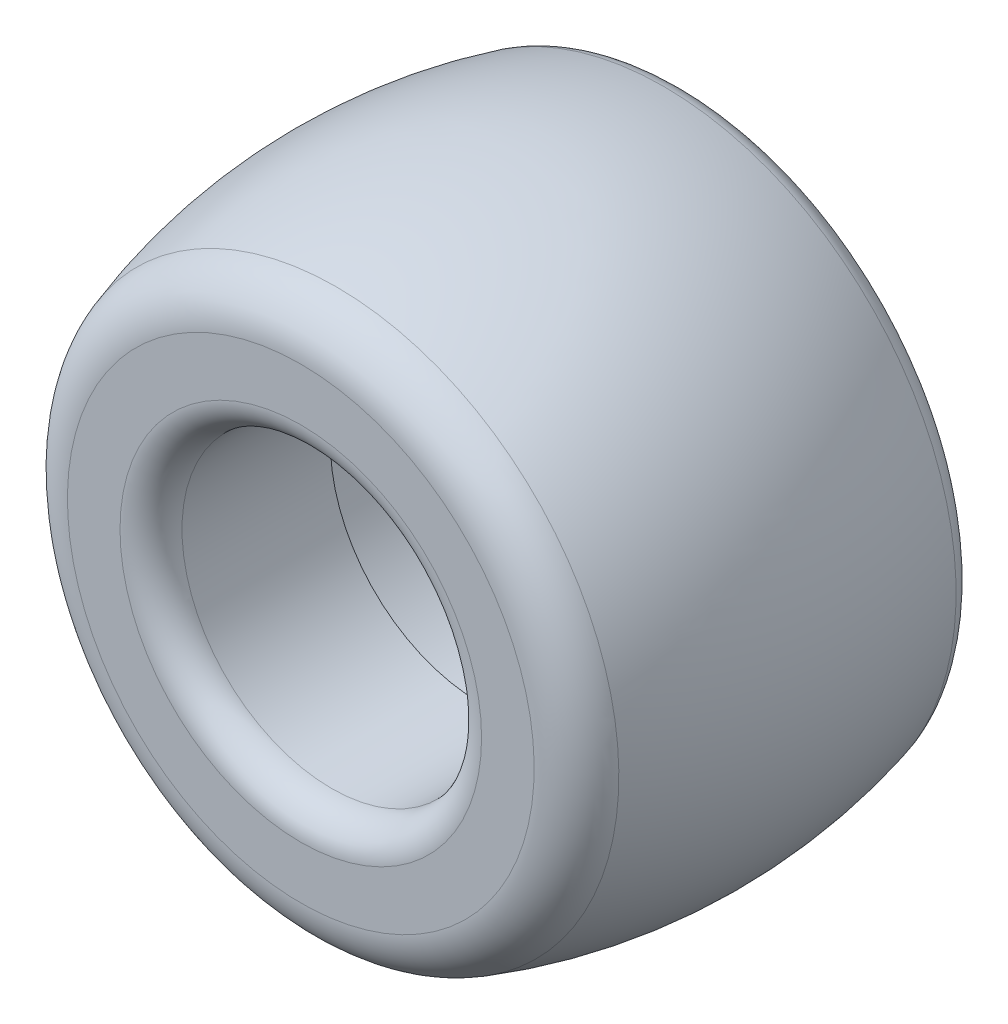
ISO-10303-21;
HEADER;
FILE_DESCRIPTION(('STEP AP214'),'2;1');
FILE_NAME('part.step','',(''),(''),'','','');
FILE_SCHEMA(('AUTOMOTIVE_DESIGN { 1 0 10303 214 1 1 1 1 }'));
ENDSEC;
DATA;
#1=APPLICATION_CONTEXT('core data for automotive mechanical design processes');
#2=APPLICATION_PROTOCOL_DEFINITION('international standard','automotive_design',2000,#1);
#3=PRODUCT_CONTEXT('',#1,'mechanical');
#4=PRODUCT('Part','Part','',(#3));
#5=PRODUCT_RELATED_PRODUCT_CATEGORY('part','',(#4));
#6=PRODUCT_DEFINITION_FORMATION('','',#4);
#7=PRODUCT_DEFINITION_CONTEXT('part definition',#1,'design');
#8=PRODUCT_DEFINITION('design','',#6,#7);
#9=PRODUCT_DEFINITION_SHAPE('','',#8);
#10=(LENGTH_UNIT() NAMED_UNIT(*) SI_UNIT(.MILLI.,.METRE.));
#11=(NAMED_UNIT(*) PLANE_ANGLE_UNIT() SI_UNIT($,.RADIAN.));
#12=(NAMED_UNIT(*) SI_UNIT($,.STERADIAN.) SOLID_ANGLE_UNIT());
#13=UNCERTAINTY_MEASURE_WITH_UNIT(LENGTH_MEASURE(1.E-05),#10,'distance_accuracy_value','');
#14=(GEOMETRIC_REPRESENTATION_CONTEXT(3) GLOBAL_UNCERTAINTY_ASSIGNED_CONTEXT((#13)) GLOBAL_UNIT_ASSIGNED_CONTEXT((#10,
#11,#12)) REPRESENTATION_CONTEXT('',''));
#15=CARTESIAN_POINT('',(0.,0.,0.));
#16=DIRECTION('',(0.,0.,1.));
#17=DIRECTION('',(1.,0.,0.));
#18=AXIS2_PLACEMENT_3D('',#15,#16,#17);
#19=CARTESIAN_POINT('',(-1716.29568384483,509.395199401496,-869.670725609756));
#20=DIRECTION('',(0.,0.,-1.));
#21=DIRECTION('',(0.,1.,0.));
#22=AXIS2_PLACEMENT_3D('',#19,#20,#21);
#23=CYLINDRICAL_SURFACE('',#22,14.4999999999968);
#24=CARTESIAN_POINT('',(-1716.29568384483,509.395199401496,-887.03564012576));
#25=DIRECTION('',(0.,0.,-1.));
#26=DIRECTION('',(0.,1.,0.));
#27=AXIS2_PLACEMENT_3D('',#24,#25,#26);
#28=CIRCLE('',#27,14.5000000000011);
#29=CARTESIAN_POINT('',(-1716.29568384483,523.895199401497,-887.03564012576));
#30=VERTEX_POINT('',#29);
#31=EDGE_CURVE('E10',#30,#30,#28,.T.);
#32=ORIENTED_EDGE('',*,*,#31,.T.);
#33=EDGE_LOOP('',(#32));
#34=FACE_BOUND('',#33,.T.);
#35=CARTESIAN_POINT('',(-1716.29568384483,509.395199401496,-872.670725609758));
#36=DIRECTION('',(0.,0.,-1.));
#37=DIRECTION('',(0.,1.,0.));
#38=AXIS2_PLACEMENT_3D('',#35,#36,#37);
#39=CIRCLE('',#38,14.4999999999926);
#40=CARTESIAN_POINT('',(-1716.29568384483,523.895199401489,-872.670725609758));
#41=VERTEX_POINT('',#40);
#42=EDGE_CURVE('E60',#41,#41,#39,.T.);
#43=ORIENTED_EDGE('',*,*,#42,.F.);
#44=EDGE_LOOP('',(#43));
#45=FACE_BOUND('',#44,.T.);
#46=ADVANCED_FACE('F29',(#34,#45),#23,.F.);
#47=CARTESIAN_POINT('',(-1701.79568384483,509.395199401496,-887.03564012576));
#48=DIRECTION('',(0.,0.,-1.));
#49=DIRECTION('',(0.,1.,0.));
#50=AXIS2_PLACEMENT_3D('',#47,#48,#49);
#51=PLANE('',#50);
#52=CARTESIAN_POINT('',(-1716.29568384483,509.395199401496,-887.03564012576));
#53=DIRECTION('',(0.,0.,-1.));
#54=DIRECTION('',(0.,1.,0.));
#55=AXIS2_PLACEMENT_3D('',#52,#53,#54);
#56=CIRCLE('',#55,17.5000000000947);
#57=CARTESIAN_POINT('',(-1716.29568384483,526.895199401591,-887.03564012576));
#58=VERTEX_POINT('',#57);
#59=EDGE_CURVE('E35',#58,#58,#56,.T.);
#60=ORIENTED_EDGE('',*,*,#59,.T.);
#61=EDGE_LOOP('',(#60));
#62=FACE_BOUND('',#61,.T.);
#63=ORIENTED_EDGE('',*,*,#31,.F.);
#64=EDGE_LOOP('',(#63));
#65=FACE_BOUND('',#64,.T.);
#66=ADVANCED_FACE('F68',(#62,#65),#51,.T.);
#67=CARTESIAN_POINT('',(-1716.29568384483,509.395199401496,-869.670725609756));
#68=DIRECTION('',(0.,0.,-1.));
#69=DIRECTION('',(0.,1.,0.));
#70=AXIS2_PLACEMENT_3D('',#67,#68,#69);
#71=CYLINDRICAL_SURFACE('',#70,17.5000000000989);
#72=CARTESIAN_POINT('',(-1716.29568384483,509.395199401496,-900.368716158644));
#73=DIRECTION('',(0.,0.,-1.));
#74=DIRECTION('',(0.,1.,0.));
#75=AXIS2_PLACEMENT_3D('',#72,#73,#74);
#76=CIRCLE('',#75,17.5000000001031);
#77=CARTESIAN_POINT('',(-1716.29568384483,526.895199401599,-900.368716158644));
#78=VERTEX_POINT('',#77);
#79=EDGE_CURVE('E39',#78,#78,#76,.T.);
#80=ORIENTED_EDGE('',*,*,#79,.T.);
#81=EDGE_LOOP('',(#80));
#82=FACE_BOUND('',#81,.T.);
#83=ORIENTED_EDGE('',*,*,#59,.F.);
#84=EDGE_LOOP('',(#83));
#85=FACE_BOUND('',#84,.T.);
#86=ADVANCED_FACE('F72',(#82,#85),#71,.F.);
#87=CARTESIAN_POINT('',(-1716.29568384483,509.395199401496,-900.368716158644));
#88=DIRECTION('',(0.,0.,-1.));
#89=DIRECTION('',(0.,1.,0.));
#90=AXIS2_PLACEMENT_3D('',#87,#88,#89);
#91=CONICAL_SURFACE('',#90,17.5000000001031,0.785398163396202);
#92=CARTESIAN_POINT('',(-1716.29568384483,509.395199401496,-906.15696046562));
#93=DIRECTION('',(0.,0.,-1.));
#94=DIRECTION('',(0.,1.,0.));
#95=AXIS2_PLACEMENT_3D('',#92,#93,#94);
#96=CIRCLE('',#95,23.2882443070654);
#97=CARTESIAN_POINT('',(-1716.29568384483,532.683443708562,-906.15696046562));
#98=VERTEX_POINT('',#97);
#99=EDGE_CURVE('E43',#98,#98,#96,.T.);
#100=ORIENTED_EDGE('',*,*,#99,.T.);
#101=EDGE_LOOP('',(#100));
#102=FACE_BOUND('',#101,.T.);
#103=ORIENTED_EDGE('',*,*,#79,.F.);
#104=EDGE_LOOP('',(#103));
#105=FACE_BOUND('',#104,.T.);
#106=ADVANCED_FACE('F76',(#102,#105),#91,.F.);
#107=CARTESIAN_POINT('',(-1716.29568384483,509.395199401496,-904.035640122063));
#108=DIRECTION('',(0.,0.,-1.));
#109=DIRECTION('',(0.,1.,0.));
#110=AXIS2_PLACEMENT_3D('',#107,#108,#109);
#111=TOROIDAL_SURFACE('',#110,25.4095646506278,3.00000000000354);
#112=CARTESIAN_POINT('',(-1716.29568384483,509.395199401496,-904.792005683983));
#113=DIRECTION('',(0.,0.,-1.));
#114=DIRECTION('',(0.,1.,0.));
#115=AXIS2_PLACEMENT_3D('',#112,#113,#114);
#116=CIRCLE('',#115,28.3126511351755);
#117=CARTESIAN_POINT('',(-1716.29568384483,537.707850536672,-904.792005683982));
#118=VERTEX_POINT('',#117);
#119=EDGE_CURVE('E48',#118,#118,#116,.T.);
#120=ORIENTED_EDGE('',*,*,#119,.T.);
#121=EDGE_LOOP('',(#120));
#122=FACE_BOUND('',#121,.T.);
#123=ORIENTED_EDGE('',*,*,#99,.F.);
#124=EDGE_LOOP('',(#123));
#125=FACE_BOUND('',#124,.T.);
#126=ADVANCED_FACE('F83',(#122,#125),#111,.T.);
#127=CARTESIAN_POINT('',(-1716.29568384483,509.395199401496,-890.607210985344));
#128=DIRECTION('',(0.,0.,-1.));
#129=DIRECTION('',(0.,1.,0.));
#130=AXIS2_PLACEMENT_3D('',#127,#128,#129);
#131=DEGENERATE_TOROIDAL_SURFACE('',#130,26.1315063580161,56.2616626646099,.F.);
#132=CARTESIAN_POINT('',(-1716.29568384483,509.395199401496,-873.116300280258));
#133=DIRECTION('',(0.,0.,-1.));
#134=DIRECTION('',(0.,1.,0.));
#135=AXIS2_PLACEMENT_3D('',#132,#133,#134);
#136=CIRCLE('',#135,27.3422510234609);
#137=CARTESIAN_POINT('',(-1716.29568384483,536.737450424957,-873.116300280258));
#138=VERTEX_POINT('',#137);
#139=EDGE_CURVE('E51',#138,#138,#136,.T.);
#140=ORIENTED_EDGE('',*,*,#139,.T.);
#141=EDGE_LOOP('',(#140));
#142=FACE_BOUND('',#141,.T.);
#143=ORIENTED_EDGE('',*,*,#119,.F.);
#144=EDGE_LOOP('',(#143));
#145=FACE_BOUND('',#144,.T.);
#146=ADVANCED_FACE('F87',(#142,#145),#131,.F.);
#147=CARTESIAN_POINT('',(-1716.29568384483,509.395199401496,-874.670725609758));
#148=DIRECTION('',(0.,0.,-1.));
#149=DIRECTION('',(0.,1.,0.));
#150=AXIS2_PLACEMENT_3D('',#147,#148,#149);
#151=TOROIDAL_SURFACE('',#150,22.5900134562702,5.00000000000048);
#152=CARTESIAN_POINT('',(-1716.29568384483,509.395199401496,-869.670725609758));
#153=DIRECTION('',(0.,0.,-1.));
#154=DIRECTION('',(0.,1.,0.));
#155=AXIS2_PLACEMENT_3D('',#152,#153,#154);
#156=CIRCLE('',#155,22.5900134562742);
#157=CARTESIAN_POINT('',(-1716.29568384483,531.98521285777,-869.670725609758));
#158=VERTEX_POINT('',#157);
#159=EDGE_CURVE('E54',#158,#158,#156,.T.);
#160=ORIENTED_EDGE('',*,*,#159,.T.);
#161=EDGE_LOOP('',(#160));
#162=FACE_BOUND('',#161,.T.);
#163=ORIENTED_EDGE('',*,*,#139,.F.);
#164=EDGE_LOOP('',(#163));
#165=FACE_BOUND('',#164,.T.);
#166=ADVANCED_FACE('F91',(#162,#165),#151,.T.);
#167=CARTESIAN_POINT('',(-1693.70567038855,509.395199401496,-869.670725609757));
#168=DIRECTION('',(0.,0.,1.));
#169=DIRECTION('',(0.,-1.,0.));
#170=AXIS2_PLACEMENT_3D('',#167,#168,#169);
#171=PLANE('',#170);
#172=CARTESIAN_POINT('',(-1716.29568384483,509.395199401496,-869.670725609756));
#173=DIRECTION('',(0.,0.,-1.));
#174=DIRECTION('',(0.,1.,0.));
#175=AXIS2_PLACEMENT_3D('',#172,#173,#174);
#176=CIRCLE('',#175,17.499999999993);
#177=CARTESIAN_POINT('',(-1716.29568384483,526.895199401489,-869.670725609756));
#178=VERTEX_POINT('',#177);
#179=EDGE_CURVE('E57',#178,#178,#176,.T.);
#180=ORIENTED_EDGE('',*,*,#179,.T.);
#181=EDGE_LOOP('',(#180));
#182=FACE_BOUND('',#181,.T.);
#183=ORIENTED_EDGE('',*,*,#159,.F.);
#184=EDGE_LOOP('',(#183));
#185=FACE_BOUND('',#184,.T.);
#186=ADVANCED_FACE('F95',(#182,#185),#171,.T.);
#187=CARTESIAN_POINT('',(-1716.29568384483,509.395199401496,-872.670725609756));
#188=DIRECTION('',(0.,0.,-1.));
#189=DIRECTION('',(0.,1.,0.));
#190=AXIS2_PLACEMENT_3D('',#187,#188,#189);
#191=TOROIDAL_SURFACE('',#190,17.4999999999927,3.00000000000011);
#192=ORIENTED_EDGE('',*,*,#42,.T.);
#193=EDGE_LOOP('',(#192));
#194=FACE_BOUND('',#193,.T.);
#195=ORIENTED_EDGE('',*,*,#179,.F.);
#196=EDGE_LOOP('',(#195));
#197=FACE_BOUND('',#196,.T.);
#198=ADVANCED_FACE('F64',(#194,#197),#191,.T.);
#199=CLOSED_SHELL('',(#46,#66,#86,#106,#126,#146,#166,#186,#198));
#200=MANIFOLD_SOLID_BREP('B2',#199);
#201=ADVANCED_BREP_SHAPE_REPRESENTATION('',(#18,#200),#14);
#202=SHAPE_DEFINITION_REPRESENTATION(#9,#201);
ENDSEC;
END-ISO-10303-21;
